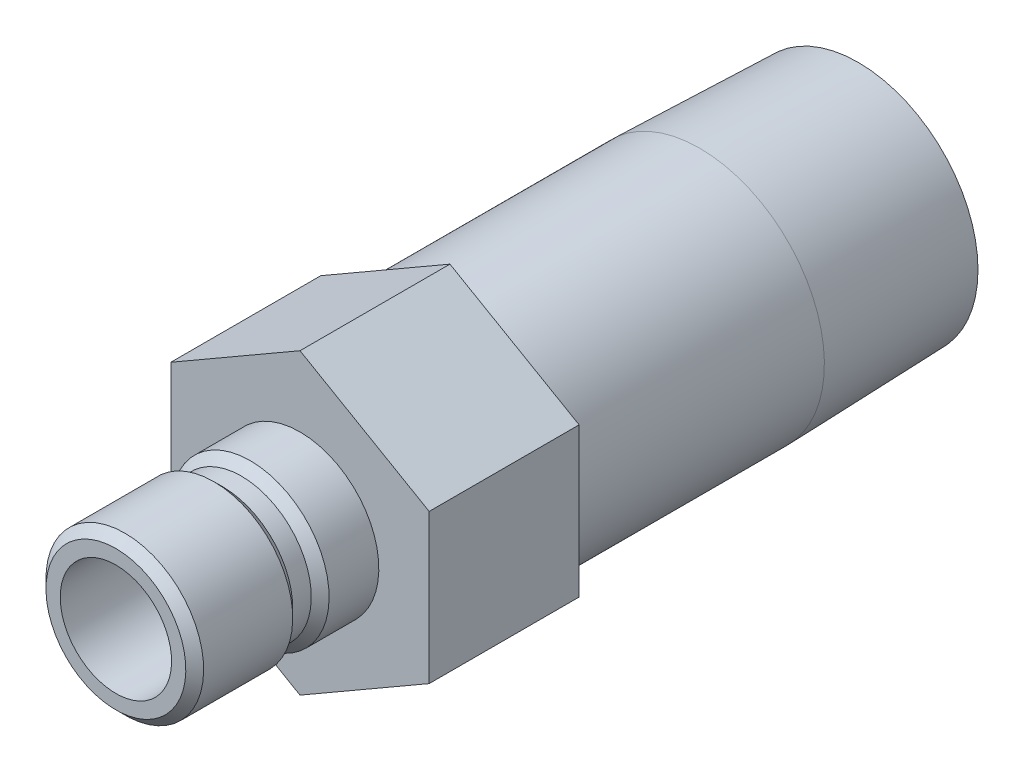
ISO-10303-21;
HEADER;
FILE_DESCRIPTION(('STEP AP214'),'2;1');
FILE_NAME('part.step','',(''),(''),'','','');
FILE_SCHEMA(('AUTOMOTIVE_DESIGN { 1 0 10303 214 1 1 1 1 }'));
ENDSEC;
DATA;
#1=APPLICATION_CONTEXT('core data for automotive mechanical design processes');
#2=APPLICATION_PROTOCOL_DEFINITION('international standard','automotive_design',2000,#1);
#3=PRODUCT_CONTEXT('',#1,'mechanical');
#4=PRODUCT('Part','Part','',(#3));
#5=PRODUCT_RELATED_PRODUCT_CATEGORY('part','',(#4));
#6=PRODUCT_DEFINITION_FORMATION('','',#4);
#7=PRODUCT_DEFINITION_CONTEXT('part definition',#1,'design');
#8=PRODUCT_DEFINITION('design','',#6,#7);
#9=PRODUCT_DEFINITION_SHAPE('','',#8);
#10=(LENGTH_UNIT() NAMED_UNIT(*) SI_UNIT(.MILLI.,.METRE.));
#11=(NAMED_UNIT(*) PLANE_ANGLE_UNIT() SI_UNIT($,.RADIAN.));
#12=(NAMED_UNIT(*) SI_UNIT($,.STERADIAN.) SOLID_ANGLE_UNIT());
#13=UNCERTAINTY_MEASURE_WITH_UNIT(LENGTH_MEASURE(1.E-05),#10,'distance_accuracy_value','');
#14=(GEOMETRIC_REPRESENTATION_CONTEXT(3) GLOBAL_UNCERTAINTY_ASSIGNED_CONTEXT((#13)) GLOBAL_UNIT_ASSIGNED_CONTEXT((#10,
#11,#12)) REPRESENTATION_CONTEXT('',''));
#15=CARTESIAN_POINT('',(0.,0.,0.));
#16=DIRECTION('',(0.,0.,1.));
#17=DIRECTION('',(1.,0.,0.));
#18=AXIS2_PLACEMENT_3D('',#15,#16,#17);
#19=CARTESIAN_POINT('',(0.,0.,0.));
#20=DIRECTION('',(0.,0.,-1.));
#21=DIRECTION('',(0.,1.,0.));
#22=AXIS2_PLACEMENT_3D('',#19,#20,#21);
#23=CYLINDRICAL_SURFACE('',#22,10.668);
#24=CARTESIAN_POINT('',(0.,0.,-34.1884));
#25=DIRECTION('',(0.,0.,-1.));
#26=DIRECTION('',(0.,1.,0.));
#27=AXIS2_PLACEMENT_3D('',#24,#25,#26);
#28=CIRCLE('',#27,10.668);
#29=CARTESIAN_POINT('',(0.,10.668,-34.1884));
#30=VERTEX_POINT('',#29);
#31=EDGE_CURVE('E168',#30,#30,#28,.T.);
#32=ORIENTED_EDGE('',*,*,#31,.F.);
#33=EDGE_LOOP('',(#32));
#34=FACE_BOUND('',#33,.T.);
#35=CARTESIAN_POINT('',(0.,0.,-12.827));
#36=DIRECTION('',(0.,0.,1.));
#37=DIRECTION('',(1.,0.,0.));
#38=AXIS2_PLACEMENT_3D('',#35,#36,#37);
#39=CIRCLE('',#38,10.668);
#40=CARTESIAN_POINT('',(10.668,0.,-12.827));
#41=VERTEX_POINT('',#40);
#42=EDGE_CURVE('E37',#41,#41,#39,.F.);
#43=ORIENTED_EDGE('',*,*,#42,.T.);
#44=EDGE_LOOP('',(#43));
#45=FACE_BOUND('',#44,.T.);
#46=ADVANCED_FACE('F33',(#34,#45),#23,.T.);
#47=CARTESIAN_POINT('',(0.,0.,0.));
#48=DIRECTION('',(0.,0.,-1.));
#49=DIRECTION('',(0.,1.,0.));
#50=AXIS2_PLACEMENT_3D('',#47,#48,#49);
#51=CYLINDRICAL_SURFACE('',#50,4.7625);
#52=CARTESIAN_POINT('',(0.,0.,15.748));
#53=DIRECTION('',(0.,0.,-1.));
#54=DIRECTION('',(0.,1.,0.));
#55=AXIS2_PLACEMENT_3D('',#52,#53,#54);
#56=CIRCLE('',#55,4.7625);
#57=CARTESIAN_POINT('',(0.,4.7625,15.748));
#58=VERTEX_POINT('',#57);
#59=EDGE_CURVE('E144',#58,#58,#56,.T.);
#60=ORIENTED_EDGE('',*,*,#59,.F.);
#61=EDGE_LOOP('',(#60));
#62=FACE_BOUND('',#61,.T.);
#63=CARTESIAN_POINT('',(0.,0.,-12.827));
#64=DIRECTION('',(0.,0.,-1.));
#65=DIRECTION('',(0.,1.,0.));
#66=AXIS2_PLACEMENT_3D('',#63,#64,#65);
#67=CIRCLE('',#66,4.76249999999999);
#68=CARTESIAN_POINT('',(0.,4.7625,-12.827));
#69=VERTEX_POINT('',#68);
#70=EDGE_CURVE('E11',#69,#69,#67,.T.);
#71=ORIENTED_EDGE('',*,*,#70,.T.);
#72=EDGE_LOOP('',(#71));
#73=FACE_BOUND('',#72,.T.);
#74=ADVANCED_FACE('F35',(#62,#73),#51,.F.);
#75=CARTESIAN_POINT('',(0.,4.7625,-12.827));
#76=DIRECTION('',(0.,0.,-1.));
#77=DIRECTION('',(0.,1.,0.));
#78=AXIS2_PLACEMENT_3D('',#75,#76,#77);
#79=PLANE('',#78);
#80=CARTESIAN_POINT('',(0.,0.,-12.827));
#81=DIRECTION('',(0.,0.,-1.));
#82=DIRECTION('',(0.,1.,0.));
#83=AXIS2_PLACEMENT_3D('',#80,#81,#82);
#84=CIRCLE('',#83,7.89939999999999);
#85=CARTESIAN_POINT('',(0.,7.8994,-12.827));
#86=VERTEX_POINT('',#85);
#87=EDGE_CURVE('E43',#86,#86,#84,.T.);
#88=ORIENTED_EDGE('',*,*,#87,.T.);
#89=EDGE_LOOP('',(#88));
#90=FACE_BOUND('',#89,.T.);
#91=ORIENTED_EDGE('',*,*,#70,.F.);
#92=EDGE_LOOP('',(#91));
#93=FACE_BOUND('',#92,.T.);
#94=ADVANCED_FACE('F180',(#90,#93),#79,.T.);
#95=CARTESIAN_POINT('',(0.,0.,0.));
#96=DIRECTION('',(0.,0.,-1.));
#97=DIRECTION('',(0.,1.,0.));
#98=AXIS2_PLACEMENT_3D('',#95,#96,#97);
#99=CYLINDRICAL_SURFACE('',#98,7.89939999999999);
#100=CARTESIAN_POINT('',(0.,0.,-47.752));
#101=DIRECTION('',(0.,0.,-1.));
#102=DIRECTION('',(0.,1.,0.));
#103=AXIS2_PLACEMENT_3D('',#100,#101,#102);
#104=CIRCLE('',#103,7.89939999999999);
#105=CARTESIAN_POINT('',(0.,7.8994,-47.752));
#106=VERTEX_POINT('',#105);
#107=EDGE_CURVE('E174',#106,#106,#104,.T.);
#108=ORIENTED_EDGE('',*,*,#107,.T.);
#109=EDGE_LOOP('',(#108));
#110=FACE_BOUND('',#109,.T.);
#111=ORIENTED_EDGE('',*,*,#87,.F.);
#112=EDGE_LOOP('',(#111));
#113=FACE_BOUND('',#112,.T.);
#114=ADVANCED_FACE('F183',(#110,#113),#99,.F.);
#115=CARTESIAN_POINT('',(0.,10.244140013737,-47.752));
#116=DIRECTION('',(0.,0.,-1.));
#117=DIRECTION('',(0.,1.,0.));
#118=AXIS2_PLACEMENT_3D('',#115,#116,#117);
#119=PLANE('',#118);
#120=CARTESIAN_POINT('',(0.,0.,-47.752));
#121=DIRECTION('',(0.,0.,-1.));
#122=DIRECTION('',(0.,1.,0.));
#123=AXIS2_PLACEMENT_3D('',#120,#121,#122);
#124=CIRCLE('',#123,10.244140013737);
#125=CARTESIAN_POINT('',(0.,10.244140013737,-47.752));
#126=VERTEX_POINT('',#125);
#127=EDGE_CURVE('E171',#126,#126,#124,.T.);
#128=ORIENTED_EDGE('',*,*,#127,.T.);
#129=EDGE_LOOP('',(#128));
#130=FACE_BOUND('',#129,.T.);
#131=ORIENTED_EDGE('',*,*,#107,.F.);
#132=EDGE_LOOP('',(#131));
#133=FACE_BOUND('',#132,.T.);
#134=ADVANCED_FACE('F185',(#130,#133),#119,.T.);
#135=CARTESIAN_POINT('',(0.,0.,-47.752));
#136=DIRECTION('',(0.,0.,1.));
#137=DIRECTION('',(0.,-1.,0.));
#138=AXIS2_PLACEMENT_3D('',#135,#136,#137);
#139=CONICAL_SURFACE('',#138,10.244140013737,0.0312396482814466);
#140=ORIENTED_EDGE('',*,*,#31,.T.);
#141=EDGE_LOOP('',(#140));
#142=FACE_BOUND('',#141,.T.);
#143=ORIENTED_EDGE('',*,*,#127,.F.);
#144=EDGE_LOOP('',(#143));
#145=FACE_BOUND('',#144,.T.);
#146=ADVANCED_FACE('F192',(#142,#145),#139,.T.);
#147=CARTESIAN_POINT('',(0.,6.7437,0.));
#148=DIRECTION('',(0.,0.,1.));
#149=DIRECTION('',(0.,-1.,0.));
#150=AXIS2_PLACEMENT_3D('',#147,#148,#149);
#151=PLANE('',#150);
#152=CARTESIAN_POINT('',(0.,0.,0.));
#153=DIRECTION('',(0.,0.,-1.));
#154=DIRECTION('',(0.,1.,0.));
#155=AXIS2_PLACEMENT_3D('',#152,#153,#154);
#156=CIRCLE('',#155,6.7437);
#157=CARTESIAN_POINT('',(0.,6.7437,0.));
#158=VERTEX_POINT('',#157);
#159=EDGE_CURVE('E165',#158,#158,#156,.T.);
#160=ORIENTED_EDGE('',*,*,#159,.T.);
#161=EDGE_LOOP('',(#160));
#162=FACE_BOUND('',#161,.T.);
#163=DIRECTION('',(-0.866025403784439,-0.5,0.));
#164=VECTOR('',#163,1.);
#165=CARTESIAN_POINT('',(0.,12.7582862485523,0.));
#166=LINE('',#165,#164);
#167=CARTESIAN_POINT('',(0.,12.7582862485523,0.));
#168=VERTEX_POINT('',#167);
#169=CARTESIAN_POINT('',(-11.049,6.37914312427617,0.));
#170=VERTEX_POINT('',#169);
#171=EDGE_CURVE('E122',#168,#170,#166,.T.);
#172=ORIENTED_EDGE('',*,*,#171,.T.);
#173=DIRECTION('',(0.,-1.,0.));
#174=VECTOR('',#173,1.);
#175=CARTESIAN_POINT('',(-11.049,6.37914312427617,0.));
#176=LINE('',#175,#174);
#177=CARTESIAN_POINT('',(-11.049,-6.37914312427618,0.));
#178=VERTEX_POINT('',#177);
#179=EDGE_CURVE('E125',#170,#178,#176,.T.);
#180=ORIENTED_EDGE('',*,*,#179,.T.);
#181=DIRECTION('',(0.866025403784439,-0.5,0.));
#182=VECTOR('',#181,1.);
#183=CARTESIAN_POINT('',(-11.049,-6.37914312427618,0.));
#184=LINE('',#183,#182);
#185=CARTESIAN_POINT('',(0.,-12.7582862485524,0.));
#186=VERTEX_POINT('',#185);
#187=EDGE_CURVE('E128',#178,#186,#184,.T.);
#188=ORIENTED_EDGE('',*,*,#187,.T.);
#189=DIRECTION('',(0.866025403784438,0.5,0.));
#190=VECTOR('',#189,1.);
#191=CARTESIAN_POINT('',(0.,-12.7582862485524,0.));
#192=LINE('',#191,#190);
#193=CARTESIAN_POINT('',(11.049,-6.37914312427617,0.));
#194=VERTEX_POINT('',#193);
#195=EDGE_CURVE('E131',#186,#194,#192,.T.);
#196=ORIENTED_EDGE('',*,*,#195,.T.);
#197=DIRECTION('',(0.,1.,0.));
#198=VECTOR('',#197,1.);
#199=CARTESIAN_POINT('',(11.049,-6.37914312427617,0.));
#200=LINE('',#199,#198);
#201=CARTESIAN_POINT('',(11.049,6.37914312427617,0.));
#202=VERTEX_POINT('',#201);
#203=EDGE_CURVE('E99',#194,#202,#200,.T.);
#204=ORIENTED_EDGE('',*,*,#203,.T.);
#205=DIRECTION('',(-0.866025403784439,0.5,0.));
#206=VECTOR('',#205,1.);
#207=CARTESIAN_POINT('',(11.049,6.37914312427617,0.));
#208=LINE('',#207,#206);
#209=EDGE_CURVE('E134',#202,#168,#208,.T.);
#210=ORIENTED_EDGE('',*,*,#209,.T.);
#211=EDGE_LOOP('',(#172,#180,#188,#196,#204,#210));
#212=FACE_BOUND('',#211,.T.);
#213=ADVANCED_FACE('F206',(#162,#212),#151,.T.);
#214=CARTESIAN_POINT('',(0.,0.,0.));
#215=DIRECTION('',(0.,0.,-1.));
#216=DIRECTION('',(0.,1.,0.));
#217=AXIS2_PLACEMENT_3D('',#214,#215,#216);
#218=CYLINDRICAL_SURFACE('',#217,6.7437);
#219=CARTESIAN_POINT('',(0.,0.,4.25449999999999));
#220=DIRECTION('',(0.,0.,-1.));
#221=DIRECTION('',(0.,1.,0.));
#222=AXIS2_PLACEMENT_3D('',#219,#220,#221);
#223=CIRCLE('',#222,6.7437);
#224=CARTESIAN_POINT('',(0.,6.7437,4.25449999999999));
#225=VERTEX_POINT('',#224);
#226=EDGE_CURVE('E162',#225,#225,#223,.T.);
#227=ORIENTED_EDGE('',*,*,#226,.T.);
#228=EDGE_LOOP('',(#227));
#229=FACE_BOUND('',#228,.T.);
#230=ORIENTED_EDGE('',*,*,#159,.F.);
#231=EDGE_LOOP('',(#230));
#232=FACE_BOUND('',#231,.T.);
#233=ADVANCED_FACE('F213',(#229,#232),#218,.T.);
#234=CARTESIAN_POINT('',(0.,0.,4.25449999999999));
#235=DIRECTION('',(0.,0.,-1.));
#236=DIRECTION('',(0.,1.,0.));
#237=AXIS2_PLACEMENT_3D('',#234,#235,#236);
#238=CONICAL_SURFACE('',#237,6.7437,0.785398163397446);
#239=CARTESIAN_POINT('',(0.,0.,5.0165));
#240=DIRECTION('',(0.,0.,-1.));
#241=DIRECTION('',(0.,1.,0.));
#242=AXIS2_PLACEMENT_3D('',#239,#240,#241);
#243=CIRCLE('',#242,5.9817);
#244=CARTESIAN_POINT('',(0.,5.9817,5.0165));
#245=VERTEX_POINT('',#244);
#246=EDGE_CURVE('E159',#245,#245,#243,.T.);
#247=ORIENTED_EDGE('',*,*,#246,.T.);
#248=EDGE_LOOP('',(#247));
#249=FACE_BOUND('',#248,.T.);
#250=ORIENTED_EDGE('',*,*,#226,.F.);
#251=EDGE_LOOP('',(#250));
#252=FACE_BOUND('',#251,.T.);
#253=ADVANCED_FACE('F222',(#249,#252),#238,.T.);
#254=CARTESIAN_POINT('',(0.,0.,0.));
#255=DIRECTION('',(0.,0.,-1.));
#256=DIRECTION('',(0.,1.,0.));
#257=AXIS2_PLACEMENT_3D('',#254,#255,#256);
#258=CYLINDRICAL_SURFACE('',#257,5.9817);
#259=CARTESIAN_POINT('',(0.,0.,6.604));
#260=DIRECTION('',(0.,0.,-1.));
#261=DIRECTION('',(0.,1.,0.));
#262=AXIS2_PLACEMENT_3D('',#259,#260,#261);
#263=CIRCLE('',#262,5.9817);
#264=CARTESIAN_POINT('',(0.,5.9817,6.604));
#265=VERTEX_POINT('',#264);
#266=EDGE_CURVE('E156',#265,#265,#263,.T.);
#267=ORIENTED_EDGE('',*,*,#266,.T.);
#268=EDGE_LOOP('',(#267));
#269=FACE_BOUND('',#268,.T.);
#270=ORIENTED_EDGE('',*,*,#246,.F.);
#271=EDGE_LOOP('',(#270));
#272=FACE_BOUND('',#271,.T.);
#273=ADVANCED_FACE('F263',(#269,#272),#258,.T.);
#274=CARTESIAN_POINT('',(0.,0.,6.604));
#275=DIRECTION('',(0.,0.,1.));
#276=DIRECTION('',(0.,-1.,0.));
#277=AXIS2_PLACEMENT_3D('',#274,#275,#276);
#278=CONICAL_SURFACE('',#277,5.9817,0.785398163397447);
#279=CARTESIAN_POINT('',(0.,0.,7.366));
#280=DIRECTION('',(0.,0.,-1.));
#281=DIRECTION('',(0.,1.,0.));
#282=AXIS2_PLACEMENT_3D('',#279,#280,#281);
#283=CIRCLE('',#282,6.7437);
#284=CARTESIAN_POINT('',(0.,6.7437,7.366));
#285=VERTEX_POINT('',#284);
#286=EDGE_CURVE('E153',#285,#285,#283,.T.);
#287=ORIENTED_EDGE('',*,*,#286,.T.);
#288=EDGE_LOOP('',(#287));
#289=FACE_BOUND('',#288,.T.);
#290=ORIENTED_EDGE('',*,*,#266,.F.);
#291=EDGE_LOOP('',(#290));
#292=FACE_BOUND('',#291,.T.);
#293=ADVANCED_FACE('F259',(#289,#292),#278,.T.);
#294=CARTESIAN_POINT('',(0.,0.,0.));
#295=DIRECTION('',(0.,0.,-1.));
#296=DIRECTION('',(0.,1.,0.));
#297=AXIS2_PLACEMENT_3D('',#294,#295,#296);
#298=CYLINDRICAL_SURFACE('',#297,6.7437);
#299=CARTESIAN_POINT('',(0.,0.,14.986));
#300=DIRECTION('',(0.,0.,-1.));
#301=DIRECTION('',(0.,1.,0.));
#302=AXIS2_PLACEMENT_3D('',#299,#300,#301);
#303=CIRCLE('',#302,6.7437);
#304=CARTESIAN_POINT('',(0.,6.7437,14.986));
#305=VERTEX_POINT('',#304);
#306=EDGE_CURVE('E150',#305,#305,#303,.T.);
#307=ORIENTED_EDGE('',*,*,#306,.T.);
#308=EDGE_LOOP('',(#307));
#309=FACE_BOUND('',#308,.T.);
#310=ORIENTED_EDGE('',*,*,#286,.F.);
#311=EDGE_LOOP('',(#310));
#312=FACE_BOUND('',#311,.T.);
#313=ADVANCED_FACE('F255',(#309,#312),#298,.T.);
#314=CARTESIAN_POINT('',(0.,0.,14.986));
#315=DIRECTION('',(0.,0.,-1.));
#316=DIRECTION('',(0.,1.,0.));
#317=AXIS2_PLACEMENT_3D('',#314,#315,#316);
#318=CONICAL_SURFACE('',#317,6.7437,0.785398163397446);
#319=CARTESIAN_POINT('',(0.,0.,15.748));
#320=DIRECTION('',(0.,0.,-1.));
#321=DIRECTION('',(0.,1.,0.));
#322=AXIS2_PLACEMENT_3D('',#319,#320,#321);
#323=CIRCLE('',#322,5.9817);
#324=CARTESIAN_POINT('',(0.,5.9817,15.748));
#325=VERTEX_POINT('',#324);
#326=EDGE_CURVE('E147',#325,#325,#323,.T.);
#327=ORIENTED_EDGE('',*,*,#326,.T.);
#328=EDGE_LOOP('',(#327));
#329=FACE_BOUND('',#328,.T.);
#330=ORIENTED_EDGE('',*,*,#306,.F.);
#331=EDGE_LOOP('',(#330));
#332=FACE_BOUND('',#331,.T.);
#333=ADVANCED_FACE('F251',(#329,#332),#318,.T.);
#334=CARTESIAN_POINT('',(0.,4.7625,15.748));
#335=DIRECTION('',(0.,0.,1.));
#336=DIRECTION('',(0.,-1.,0.));
#337=AXIS2_PLACEMENT_3D('',#334,#335,#336);
#338=PLANE('',#337);
#339=ORIENTED_EDGE('',*,*,#59,.T.);
#340=EDGE_LOOP('',(#339));
#341=FACE_BOUND('',#340,.T.);
#342=ORIENTED_EDGE('',*,*,#326,.F.);
#343=EDGE_LOOP('',(#342));
#344=FACE_BOUND('',#343,.T.);
#345=ADVANCED_FACE('F239',(#341,#344),#338,.T.);
#346=CARTESIAN_POINT('',(0.,12.7582862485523,-12.827));
#347=DIRECTION('',(-0.5,0.866025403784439,0.));
#348=DIRECTION('',(-0.866025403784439,-0.5,0.));
#349=AXIS2_PLACEMENT_3D('',#346,#347,#348);
#350=PLANE('',#349);
#351=ORIENTED_EDGE('',*,*,#171,.F.);
#352=DIRECTION('',(0.,0.,1.));
#353=VECTOR('',#352,1.);
#354=CARTESIAN_POINT('',(0.,12.7582862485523,-12.827));
#355=LINE('',#354,#353);
#356=CARTESIAN_POINT('',(0.,12.7582862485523,-12.827));
#357=VERTEX_POINT('',#356);
#358=EDGE_CURVE('E51',#357,#168,#355,.T.);
#359=ORIENTED_EDGE('',*,*,#358,.F.);
#360=DIRECTION('',(-0.866025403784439,-0.5,0.));
#361=VECTOR('',#360,1.);
#362=CARTESIAN_POINT('',(0.,12.7582862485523,-12.827));
#363=LINE('',#362,#361);
#364=CARTESIAN_POINT('',(-11.049,6.37914312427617,-12.827));
#365=VERTEX_POINT('',#364);
#366=EDGE_CURVE('E137',#357,#365,#363,.T.);
#367=ORIENTED_EDGE('',*,*,#366,.T.);
#368=DIRECTION('',(0.,0.,1.));
#369=VECTOR('',#368,1.);
#370=CARTESIAN_POINT('',(-11.049,6.37914312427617,-12.827));
#371=LINE('',#370,#369);
#372=EDGE_CURVE('E86',#365,#170,#371,.T.);
#373=ORIENTED_EDGE('',*,*,#372,.T.);
#374=EDGE_LOOP('',(#351,#359,#367,#373));
#375=FACE_BOUND('',#374,.T.);
#376=ADVANCED_FACE('F226',(#375),#350,.T.);
#377=CARTESIAN_POINT('',(11.049,6.37914312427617,-12.827));
#378=DIRECTION('',(0.5,0.866025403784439,0.));
#379=DIRECTION('',(-0.866025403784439,0.5,0.));
#380=AXIS2_PLACEMENT_3D('',#377,#378,#379);
#381=PLANE('',#380);
#382=ORIENTED_EDGE('',*,*,#209,.F.);
#383=DIRECTION('',(0.,0.,1.));
#384=VECTOR('',#383,1.);
#385=CARTESIAN_POINT('',(11.049,6.37914312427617,-12.827));
#386=LINE('',#385,#384);
#387=CARTESIAN_POINT('',(11.049,6.37914312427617,-12.827));
#388=VERTEX_POINT('',#387);
#389=EDGE_CURVE('E74',#388,#202,#386,.T.);
#390=ORIENTED_EDGE('',*,*,#389,.F.);
#391=DIRECTION('',(-0.866025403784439,0.5,0.));
#392=VECTOR('',#391,1.);
#393=CARTESIAN_POINT('',(11.049,6.37914312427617,-12.827));
#394=LINE('',#393,#392);
#395=EDGE_CURVE('E112',#388,#357,#394,.T.);
#396=ORIENTED_EDGE('',*,*,#395,.T.);
#397=ORIENTED_EDGE('',*,*,#358,.T.);
#398=EDGE_LOOP('',(#382,#390,#396,#397));
#399=FACE_BOUND('',#398,.T.);
#400=ADVANCED_FACE('F231',(#399),#381,.T.);
#401=CARTESIAN_POINT('',(11.049,-6.37914312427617,-12.827));
#402=DIRECTION('',(1.,0.,0.));
#403=DIRECTION('',(0.,0.,-1.));
#404=AXIS2_PLACEMENT_3D('',#401,#402,#403);
#405=PLANE('',#404);
#406=ORIENTED_EDGE('',*,*,#203,.F.);
#407=DIRECTION('',(0.,0.,1.));
#408=VECTOR('',#407,1.);
#409=CARTESIAN_POINT('',(11.049,-6.37914312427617,-12.827));
#410=LINE('',#409,#408);
#411=CARTESIAN_POINT('',(11.049,-6.37914312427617,-12.827));
#412=VERTEX_POINT('',#411);
#413=EDGE_CURVE('E94',#412,#194,#410,.T.);
#414=ORIENTED_EDGE('',*,*,#413,.F.);
#415=DIRECTION('',(0.,1.,0.));
#416=VECTOR('',#415,1.);
#417=CARTESIAN_POINT('',(11.049,-6.37914312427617,-12.827));
#418=LINE('',#417,#416);
#419=EDGE_CURVE('E97',#412,#388,#418,.T.);
#420=ORIENTED_EDGE('',*,*,#419,.T.);
#421=ORIENTED_EDGE('',*,*,#389,.T.);
#422=EDGE_LOOP('',(#406,#414,#420,#421));
#423=FACE_BOUND('',#422,.T.);
#424=ADVANCED_FACE('F96',(#423),#405,.T.);
#425=CARTESIAN_POINT('',(0.,-12.7582862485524,-12.827));
#426=DIRECTION('',(0.5,-0.866025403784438,0.));
#427=DIRECTION('',(0.866025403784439,0.5,0.));
#428=AXIS2_PLACEMENT_3D('',#425,#426,#427);
#429=PLANE('',#428);
#430=ORIENTED_EDGE('',*,*,#195,.F.);
#431=DIRECTION('',(0.,0.,1.));
#432=VECTOR('',#431,1.);
#433=CARTESIAN_POINT('',(0.,-12.7582862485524,-12.827));
#434=LINE('',#433,#432);
#435=CARTESIAN_POINT('',(0.,-12.7582862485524,-12.827));
#436=VERTEX_POINT('',#435);
#437=EDGE_CURVE('E104',#436,#186,#434,.T.);
#438=ORIENTED_EDGE('',*,*,#437,.F.);
#439=DIRECTION('',(0.866025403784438,0.5,0.));
#440=VECTOR('',#439,1.);
#441=CARTESIAN_POINT('',(0.,-12.7582862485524,-12.827));
#442=LINE('',#441,#440);
#443=EDGE_CURVE('E110',#436,#412,#442,.T.);
#444=ORIENTED_EDGE('',*,*,#443,.T.);
#445=ORIENTED_EDGE('',*,*,#413,.T.);
#446=EDGE_LOOP('',(#430,#438,#444,#445));
#447=FACE_BOUND('',#446,.T.);
#448=ADVANCED_FACE('F114',(#447),#429,.T.);
#449=CARTESIAN_POINT('',(-11.049,-6.37914312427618,-12.827));
#450=DIRECTION('',(-0.5,-0.866025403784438,0.));
#451=DIRECTION('',(0.866025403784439,-0.5,0.));
#452=AXIS2_PLACEMENT_3D('',#449,#450,#451);
#453=PLANE('',#452);
#454=ORIENTED_EDGE('',*,*,#187,.F.);
#455=DIRECTION('',(0.,0.,1.));
#456=VECTOR('',#455,1.);
#457=CARTESIAN_POINT('',(-11.049,-6.37914312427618,-12.827));
#458=LINE('',#457,#456);
#459=CARTESIAN_POINT('',(-11.049,-6.37914312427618,-12.827));
#460=VERTEX_POINT('',#459);
#461=EDGE_CURVE('E141',#460,#178,#458,.T.);
#462=ORIENTED_EDGE('',*,*,#461,.F.);
#463=DIRECTION('',(0.866025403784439,-0.5,0.));
#464=VECTOR('',#463,1.);
#465=CARTESIAN_POINT('',(-11.049,-6.37914312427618,-12.827));
#466=LINE('',#465,#464);
#467=EDGE_CURVE('E115',#460,#436,#466,.T.);
#468=ORIENTED_EDGE('',*,*,#467,.T.);
#469=ORIENTED_EDGE('',*,*,#437,.T.);
#470=EDGE_LOOP('',(#454,#462,#468,#469));
#471=FACE_BOUND('',#470,.T.);
#472=ADVANCED_FACE('F230',(#471),#453,.T.);
#473=CARTESIAN_POINT('',(-11.049,6.37914312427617,-12.827));
#474=DIRECTION('',(-1.,0.,0.));
#475=DIRECTION('',(0.,0.,1.));
#476=AXIS2_PLACEMENT_3D('',#473,#474,#475);
#477=PLANE('',#476);
#478=ORIENTED_EDGE('',*,*,#179,.F.);
#479=ORIENTED_EDGE('',*,*,#372,.F.);
#480=DIRECTION('',(0.,-1.,0.));
#481=VECTOR('',#480,1.);
#482=CARTESIAN_POINT('',(-11.049,6.37914312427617,-12.827));
#483=LINE('',#482,#481);
#484=EDGE_CURVE('E117',#365,#460,#483,.T.);
#485=ORIENTED_EDGE('',*,*,#484,.T.);
#486=ORIENTED_EDGE('',*,*,#461,.T.);
#487=EDGE_LOOP('',(#478,#479,#485,#486));
#488=FACE_BOUND('',#487,.T.);
#489=ADVANCED_FACE('F227',(#488),#477,.T.);
#490=CARTESIAN_POINT('',(-11.049,6.37914312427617,-12.827));
#491=DIRECTION('',(0.,0.,1.));
#492=DIRECTION('',(1.,0.,0.));
#493=AXIS2_PLACEMENT_3D('',#490,#491,#492);
#494=PLANE('',#493);
#495=ORIENTED_EDGE('',*,*,#42,.F.);
#496=EDGE_LOOP('',(#495));
#497=FACE_BOUND('',#496,.T.);
#498=ORIENTED_EDGE('',*,*,#366,.F.);
#499=ORIENTED_EDGE('',*,*,#395,.F.);
#500=ORIENTED_EDGE('',*,*,#419,.F.);
#501=ORIENTED_EDGE('',*,*,#443,.F.);
#502=ORIENTED_EDGE('',*,*,#467,.F.);
#503=ORIENTED_EDGE('',*,*,#484,.F.);
#504=EDGE_LOOP('',(#498,#499,#500,#501,#502,#503));
#505=FACE_BOUND('',#504,.T.);
#506=ADVANCED_FACE('F108',(#497,#505),#494,.F.);
#507=CLOSED_SHELL('',(#46,#74,#94,#114,#134,#146,#213,#233,#253,#273,#293,#313,#333,#345,#376,
#400,#424,#448,#472,#489,#506));
#508=MANIFOLD_SOLID_BREP('B2',#507);
#509=ADVANCED_BREP_SHAPE_REPRESENTATION('',(#18,#508),#14);
#510=SHAPE_DEFINITION_REPRESENTATION(#9,#509);
ENDSEC;
END-ISO-10303-21;
